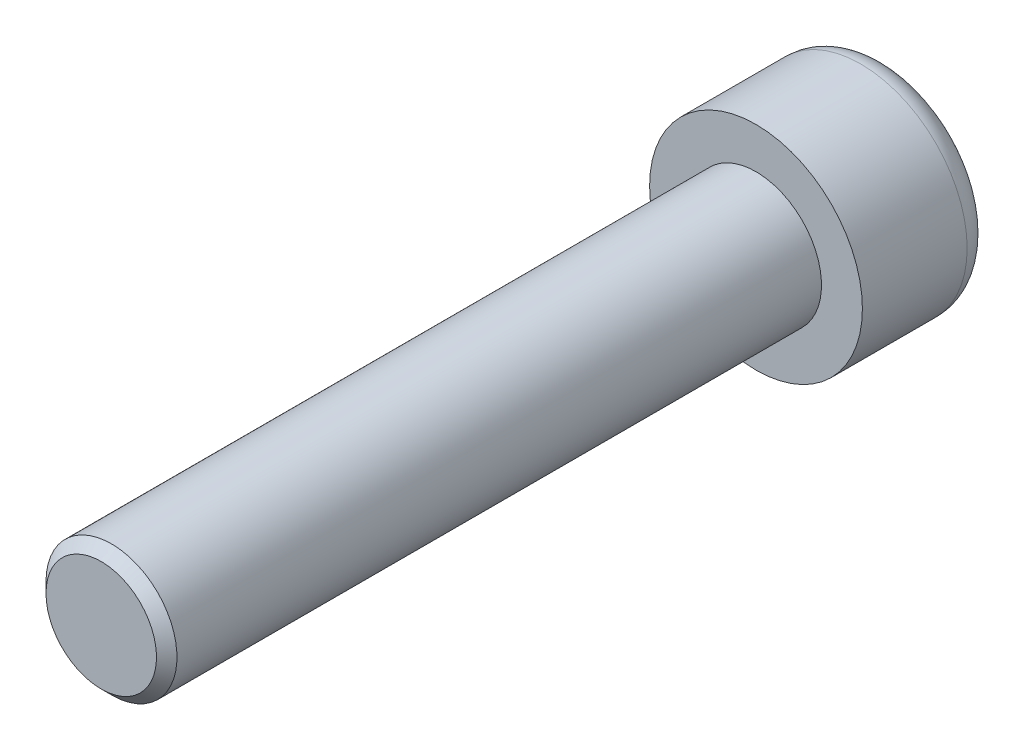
from build123d import *

# Parameters (mm, degrees)
PROFIL_T_TE_R         = 6.5
TETE_DEPTH            = 8
SIX_PANS_DEPTH        = 5
CONGE_R               = 1.6
PROFIL_CYLINDRE_R     = 4
CYLINDRE_FILETE_DEPTH = 40


with BuildPart() as part:
    # profil t_te → TETE (new body)
    with BuildSketch(Plane.XY):
        with Locations(Location((0, 0, 0), (0, 0, 180))):
            Circle(PROFIL_T_TE_R)
    extrude(amount=TETE_DEPTH)

    # profil six pans → SIX PANS (cut)
    with BuildSketch(Plane(origin=(0, 0, 0), x_dir=(-1, 0, 0), z_dir=(0, 0, -1))):
        Polygon((0, 3.464101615), (-3, 1.732050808), (-3, -1.732050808), (0, -3.464101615), (3, -1.732050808), (3, 1.732050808), align=None)
    extrude(amount=-SIX_PANS_DEPTH, mode=Mode.SUBTRACT)

    # CONGE
    conge_edges = [part.edges().sort_by_distance(p)[0] for p in [
        (6.5, 0, 0),
    ]]
    fillet(conge_edges, radius=CONGE_R)

    # profil cylindre → CYLINDRE FILETE (add)
    with BuildSketch(Plane.XY.offset(8)):
        with Locations(Location((0, 0, 0), (0, 0, 180))):
            Circle(PROFIL_CYLINDRE_R)
    extrude(amount=CYLINDRE_FILETE_DEPTH)

    # profil chanfrein → CHANFREIN FILET (revolve, cut)
    with BuildSketch(Plane(origin=(0, 0, 0), x_dir=(0, 0, -1), z_dir=(1, 0, 0)), mode=Mode.PRIVATE) as chanfrein_filet_sk:
        Polygon((-48, 3.375), (-47.375, 4), (-48, 4), align=None)
    revolve(chanfrein_filet_sk.sketch.rotate(Axis((0, 0, 12.087417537), (0, 0, 1)), 90), axis=Axis((0, 0, 12.087417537), (0, 0, 1)), mode=Mode.SUBTRACT)


solid = part.part
